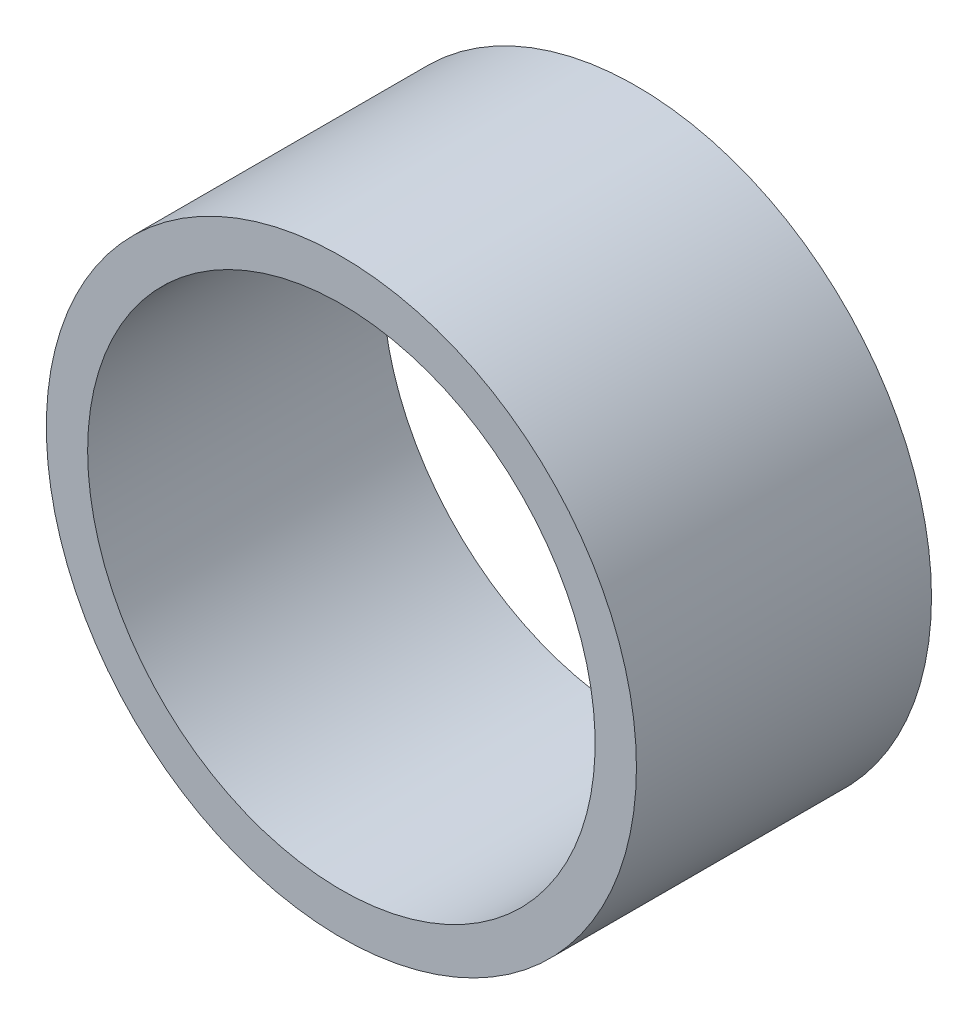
from build123d import *

# Parameters (mm, degrees)
SKETCH1_R          = 6.35
BASE_EXTRUDE_DEPTH = 6.35
SKETCH3_R          = 5.461
CUT_EXTRUDE1_DEPTH = 11.998522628


with BuildPart() as part:
    # Sketch1 → Base-Extrude (new body)
    with BuildSketch(Plane.XY):
        Circle(SKETCH1_R)
    extrude(amount=BASE_EXTRUDE_DEPTH)

    # Sketch3 → Cut-Extrude1 (cut, through all)
    with BuildSketch(Plane(origin=(0, 0, 0), x_dir=(-1, 0, 0), z_dir=(0, 0, -1))):
        Circle(SKETCH3_R)
    extrude(amount=-CUT_EXTRUDE1_DEPTH, mode=Mode.SUBTRACT)


solid = part.part
